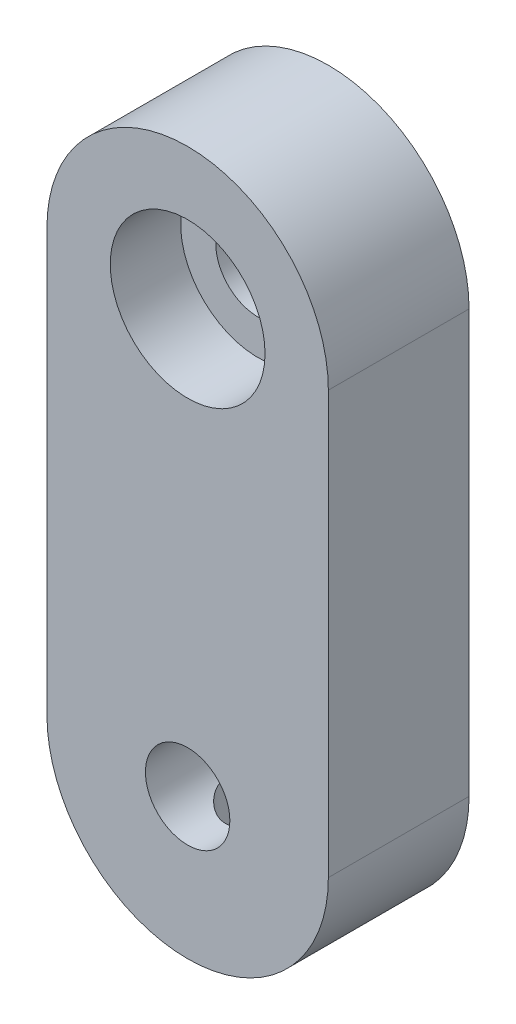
from build123d import *

# Parameters (mm, degrees)
SKETCH1_R          = 3
EXTRUDE1_DEPTH     = 10
SKETCH2_R          = 2
EXTRUDE2_DEPTH     = 43.426406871
SKETCH3_R          = 5.5
CUT_EXTRUDE1_DEPTH = 5


with BuildPart() as part:
    # Sketch1 → Extrude1 (new body)
    with BuildSketch(Plane.XY):
        with BuildLine():
            Line((10, 0), (10, 30))
            ThreePointArc((10, 30), (0, 40), (-10, 30))
            Line((-10, 30), (-10, 0))
            ThreePointArc((-10, 0), (0, -10), (10, 0))
        make_face()
        with Locations((0, 30)):
            Circle(SKETCH1_R, mode=Mode.SUBTRACT)
        Circle(SKETCH1_R, mode=Mode.SUBTRACT)
    extrude(amount=EXTRUDE1_DEPTH)

    # Sketch2 → Extrude2 (cut, through all)
    with BuildSketch(Plane(origin=(0, 0, 0), x_dir=(1, 0, 0), z_dir=(0, 1, 0))):
        with Locations(Location((0, -5.325079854, 0), (0, 0, 270))):
            Circle(SKETCH2_R)
    extrude(amount=-EXTRUDE2_DEPTH, mode=Mode.SUBTRACT)

    # Sketch3 → Cut-Extrude1 (cut)
    with BuildSketch(Plane.XY.offset(10)):
        with Locations((0, 30)):
            Circle(SKETCH3_R)
    extrude(amount=-CUT_EXTRUDE1_DEPTH, mode=Mode.SUBTRACT)


solid = part.part
